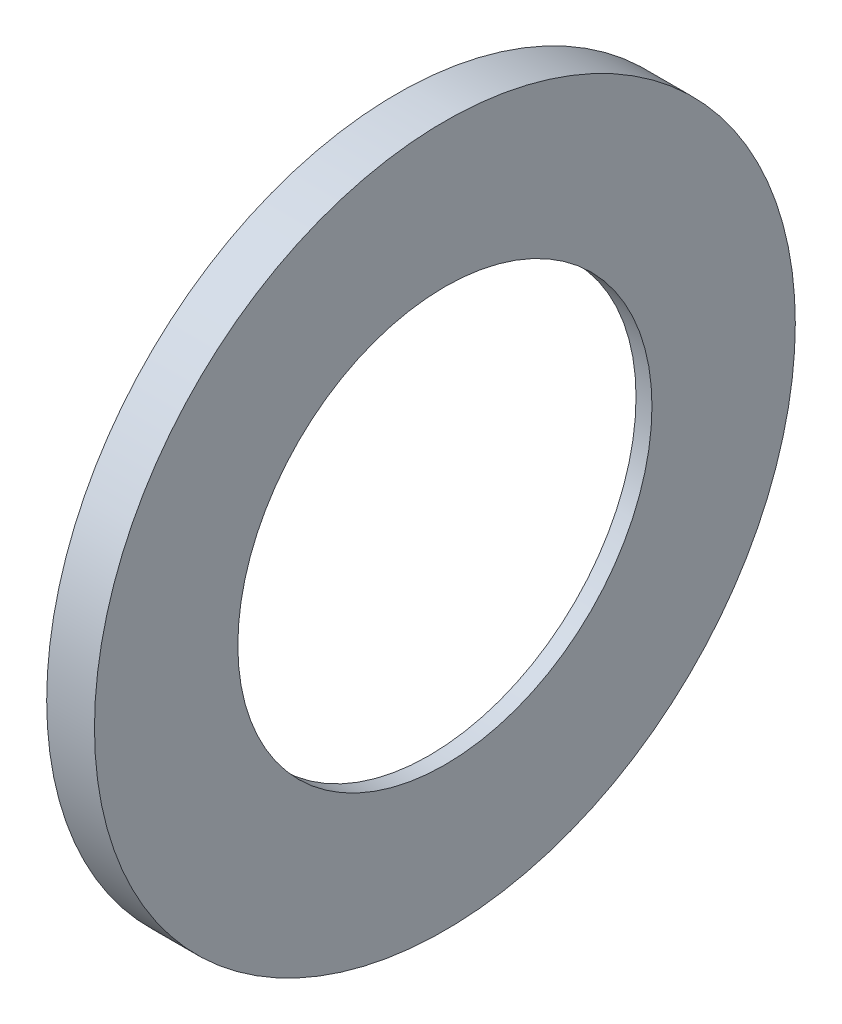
ISO-10303-21;
HEADER;
FILE_DESCRIPTION(('STEP AP214'),'2;1');
FILE_NAME('part.step','',(''),(''),'','','');
FILE_SCHEMA(('AUTOMOTIVE_DESIGN { 1 0 10303 214 1 1 1 1 }'));
ENDSEC;
DATA;
#1=APPLICATION_CONTEXT('core data for automotive mechanical design processes');
#2=APPLICATION_PROTOCOL_DEFINITION('international standard','automotive_design',2000,#1);
#3=PRODUCT_CONTEXT('',#1,'mechanical');
#4=PRODUCT('Part','Part','',(#3));
#5=PRODUCT_RELATED_PRODUCT_CATEGORY('part','',(#4));
#6=PRODUCT_DEFINITION_FORMATION('','',#4);
#7=PRODUCT_DEFINITION_CONTEXT('part definition',#1,'design');
#8=PRODUCT_DEFINITION('design','',#6,#7);
#9=PRODUCT_DEFINITION_SHAPE('','',#8);
#10=(LENGTH_UNIT() NAMED_UNIT(*) SI_UNIT(.MILLI.,.METRE.));
#11=(NAMED_UNIT(*) PLANE_ANGLE_UNIT() SI_UNIT($,.RADIAN.));
#12=(NAMED_UNIT(*) SI_UNIT($,.STERADIAN.) SOLID_ANGLE_UNIT());
#13=UNCERTAINTY_MEASURE_WITH_UNIT(LENGTH_MEASURE(1.E-05),#10,'distance_accuracy_value','');
#14=(GEOMETRIC_REPRESENTATION_CONTEXT(3) GLOBAL_UNCERTAINTY_ASSIGNED_CONTEXT((#13)) GLOBAL_UNIT_ASSIGNED_CONTEXT((#10,
#11,#12)) REPRESENTATION_CONTEXT('',''));
#15=CARTESIAN_POINT('',(0.,0.,0.));
#16=DIRECTION('',(0.,0.,1.));
#17=DIRECTION('',(1.,0.,0.));
#18=AXIS2_PLACEMENT_3D('',#15,#16,#17);
#19=CARTESIAN_POINT('',(2.,21.,0.));
#20=DIRECTION('',(1.,0.,0.));
#21=DIRECTION('',(0.,0.,-1.));
#22=AXIS2_PLACEMENT_3D('',#19,#20,#21);
#23=PLANE('',#22);
#24=CARTESIAN_POINT('',(2.,0.,0.));
#25=DIRECTION('',(-1.,0.,0.));
#26=DIRECTION('',(0.,0.,1.));
#27=AXIS2_PLACEMENT_3D('',#24,#25,#26);
#28=CIRCLE('',#27,13.);
#29=CARTESIAN_POINT('',(2.,0.,13.));
#30=VERTEX_POINT('',#29);
#31=EDGE_CURVE('E10',#30,#30,#28,.T.);
#32=ORIENTED_EDGE('',*,*,#31,.F.);
#33=EDGE_LOOP('',(#32));
#34=FACE_BOUND('',#33,.T.);
#35=CARTESIAN_POINT('',(2.,0.,0.));
#36=DIRECTION('',(-1.,0.,0.));
#37=DIRECTION('',(0.,0.,1.));
#38=AXIS2_PLACEMENT_3D('',#35,#36,#37);
#39=CIRCLE('',#38,21.);
#40=CARTESIAN_POINT('',(2.,0.,21.));
#41=VERTEX_POINT('',#40);
#42=EDGE_CURVE('E370',#41,#41,#39,.T.);
#43=ORIENTED_EDGE('',*,*,#42,.T.);
#44=EDGE_LOOP('',(#43));
#45=FACE_BOUND('',#44,.T.);
#46=ADVANCED_FACE('F348',(#34,#45),#23,.F.);
#47=CARTESIAN_POINT('',(0.,0.,0.));
#48=DIRECTION('',(-1.,0.,0.));
#49=DIRECTION('',(0.,0.,1.));
#50=AXIS2_PLACEMENT_3D('',#47,#48,#49);
#51=CYLINDRICAL_SURFACE('',#50,13.);
#52=CARTESIAN_POINT('',(3.,0.,0.));
#53=DIRECTION('',(-1.,0.,0.));
#54=DIRECTION('',(0.,0.,1.));
#55=AXIS2_PLACEMENT_3D('',#52,#53,#54);
#56=CIRCLE('',#55,13.);
#57=CARTESIAN_POINT('',(3.,0.,13.));
#58=VERTEX_POINT('',#57);
#59=EDGE_CURVE('E354',#58,#58,#56,.T.);
#60=ORIENTED_EDGE('',*,*,#59,.F.);
#61=EDGE_LOOP('',(#60));
#62=FACE_BOUND('',#61,.T.);
#63=ORIENTED_EDGE('',*,*,#31,.T.);
#64=EDGE_LOOP('',(#63));
#65=FACE_BOUND('',#64,.T.);
#66=ADVANCED_FACE('F395',(#62,#65),#51,.F.);
#67=CARTESIAN_POINT('',(3.,13.,0.));
#68=DIRECTION('',(-1.,0.,0.));
#69=DIRECTION('',(0.,0.,1.));
#70=AXIS2_PLACEMENT_3D('',#67,#68,#69);
#71=PLANE('',#70);
#72=CARTESIAN_POINT('',(3.,0.,0.));
#73=DIRECTION('',(-1.,0.,0.));
#74=DIRECTION('',(0.,0.,1.));
#75=AXIS2_PLACEMENT_3D('',#72,#73,#74);
#76=CIRCLE('',#75,22.);
#77=CARTESIAN_POINT('',(3.,0.,22.));
#78=VERTEX_POINT('',#77);
#79=EDGE_CURVE('E358',#78,#78,#76,.T.);
#80=ORIENTED_EDGE('',*,*,#79,.F.);
#81=EDGE_LOOP('',(#80));
#82=FACE_BOUND('',#81,.T.);
#83=ORIENTED_EDGE('',*,*,#59,.T.);
#84=EDGE_LOOP('',(#83));
#85=FACE_BOUND('',#84,.T.);
#86=ADVANCED_FACE('F390',(#82,#85),#71,.F.);
#87=CARTESIAN_POINT('',(0.,0.,0.));
#88=DIRECTION('',(-1.,0.,0.));
#89=DIRECTION('',(0.,0.,1.));
#90=AXIS2_PLACEMENT_3D('',#87,#88,#89);
#91=CYLINDRICAL_SURFACE('',#90,22.);
#92=CARTESIAN_POINT('',(0.,0.,0.));
#93=DIRECTION('',(-1.,0.,0.));
#94=DIRECTION('',(0.,0.,1.));
#95=AXIS2_PLACEMENT_3D('',#92,#93,#94);
#96=CIRCLE('',#95,22.);
#97=CARTESIAN_POINT('',(0.,0.,22.));
#98=VERTEX_POINT('',#97);
#99=EDGE_CURVE('E362',#98,#98,#96,.T.);
#100=ORIENTED_EDGE('',*,*,#99,.F.);
#101=EDGE_LOOP('',(#100));
#102=FACE_BOUND('',#101,.T.);
#103=ORIENTED_EDGE('',*,*,#79,.T.);
#104=EDGE_LOOP('',(#103));
#105=FACE_BOUND('',#104,.T.);
#106=ADVANCED_FACE('F384',(#102,#105),#91,.T.);
#107=CARTESIAN_POINT('',(0.,22.,0.));
#108=DIRECTION('',(1.,0.,0.));
#109=DIRECTION('',(0.,0.,-1.));
#110=AXIS2_PLACEMENT_3D('',#107,#108,#109);
#111=PLANE('',#110);
#112=CARTESIAN_POINT('',(0.,0.,0.));
#113=DIRECTION('',(-1.,0.,0.));
#114=DIRECTION('',(0.,0.,1.));
#115=AXIS2_PLACEMENT_3D('',#112,#113,#114);
#116=CIRCLE('',#115,21.);
#117=CARTESIAN_POINT('',(0.,0.,21.));
#118=VERTEX_POINT('',#117);
#119=EDGE_CURVE('E367',#118,#118,#116,.T.);
#120=ORIENTED_EDGE('',*,*,#119,.F.);
#121=EDGE_LOOP('',(#120));
#122=FACE_BOUND('',#121,.T.);
#123=ORIENTED_EDGE('',*,*,#99,.T.);
#124=EDGE_LOOP('',(#123));
#125=FACE_BOUND('',#124,.T.);
#126=ADVANCED_FACE('F378',(#122,#125),#111,.F.);
#127=CARTESIAN_POINT('',(0.,0.,0.));
#128=DIRECTION('',(-1.,0.,0.));
#129=DIRECTION('',(0.,0.,1.));
#130=AXIS2_PLACEMENT_3D('',#127,#128,#129);
#131=CYLINDRICAL_SURFACE('',#130,21.);
#132=ORIENTED_EDGE('',*,*,#42,.F.);
#133=EDGE_LOOP('',(#132));
#134=FACE_BOUND('',#133,.T.);
#135=ORIENTED_EDGE('',*,*,#119,.T.);
#136=EDGE_LOOP('',(#135));
#137=FACE_BOUND('',#136,.T.);
#138=ADVANCED_FACE('F375',(#134,#137),#131,.F.);
#139=CLOSED_SHELL('',(#46,#66,#86,#106,#126,#138));
#140=MANIFOLD_SOLID_BREP('B2',#139);
#141=ADVANCED_BREP_SHAPE_REPRESENTATION('',(#18,#140),#14);
#142=SHAPE_DEFINITION_REPRESENTATION(#9,#141);
ENDSEC;
END-ISO-10303-21;
